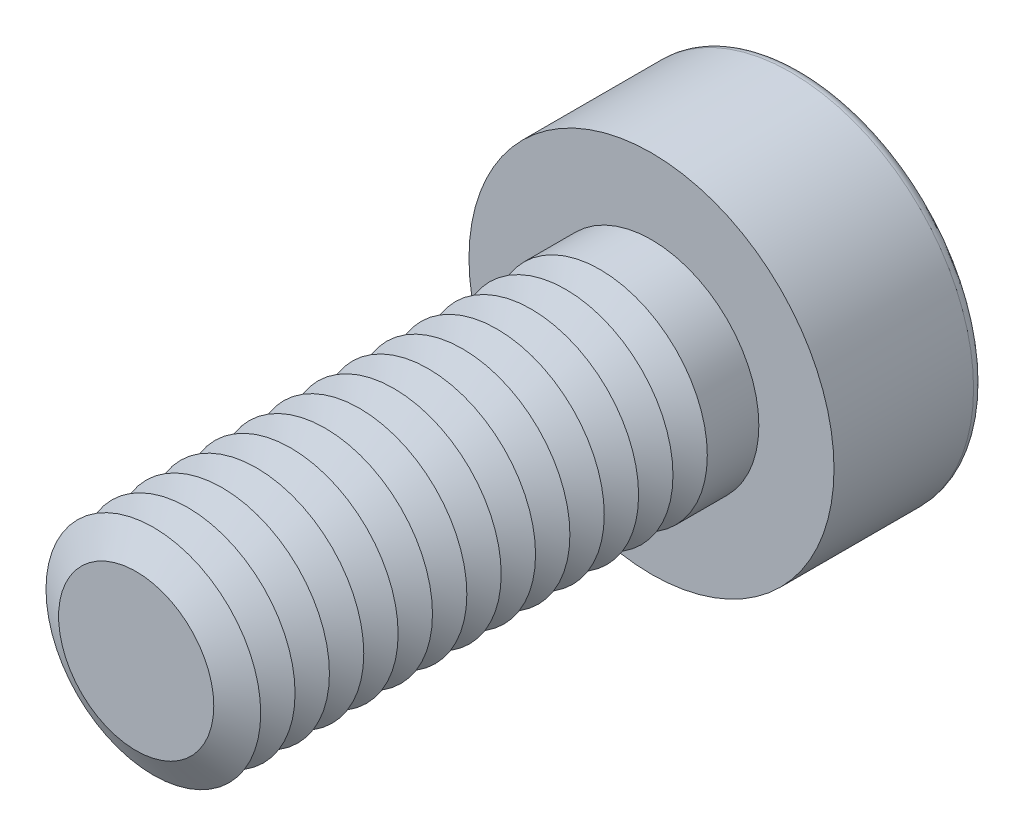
ISO-10303-21;
HEADER;
FILE_DESCRIPTION(('STEP AP214'),'2;1');
FILE_NAME('part.step','',(''),(''),'','','');
FILE_SCHEMA(('AUTOMOTIVE_DESIGN { 1 0 10303 214 1 1 1 1 }'));
ENDSEC;
DATA;
#1=APPLICATION_CONTEXT('core data for automotive mechanical design processes');
#2=APPLICATION_PROTOCOL_DEFINITION('international standard','automotive_design',2000,#1);
#3=PRODUCT_CONTEXT('',#1,'mechanical');
#4=PRODUCT('Part','Part','',(#3));
#5=PRODUCT_RELATED_PRODUCT_CATEGORY('part','',(#4));
#6=PRODUCT_DEFINITION_FORMATION('','',#4);
#7=PRODUCT_DEFINITION_CONTEXT('part definition',#1,'design');
#8=PRODUCT_DEFINITION('design','',#6,#7);
#9=PRODUCT_DEFINITION_SHAPE('','',#8);
#10=(LENGTH_UNIT() NAMED_UNIT(*) SI_UNIT(.MILLI.,.METRE.));
#11=(NAMED_UNIT(*) PLANE_ANGLE_UNIT() SI_UNIT($,.RADIAN.));
#12=(NAMED_UNIT(*) SI_UNIT($,.STERADIAN.) SOLID_ANGLE_UNIT());
#13=UNCERTAINTY_MEASURE_WITH_UNIT(LENGTH_MEASURE(1.E-05),#10,'distance_accuracy_value','');
#14=(GEOMETRIC_REPRESENTATION_CONTEXT(3) GLOBAL_UNCERTAINTY_ASSIGNED_CONTEXT((#13)) GLOBAL_UNIT_ASSIGNED_CONTEXT((#10,
#11,#12)) REPRESENTATION_CONTEXT('',''));
#15=CARTESIAN_POINT('',(0.,0.,0.));
#16=DIRECTION('',(0.,0.,1.));
#17=DIRECTION('',(1.,0.,0.));
#18=AXIS2_PLACEMENT_3D('',#15,#16,#17);
#19=CARTESIAN_POINT('',(0.,0.,9.2));
#20=DIRECTION('',(0.,0.,1.));
#21=DIRECTION('',(1.,0.,0.));
#22=AXIS2_PLACEMENT_3D('',#19,#20,#21);
#23=CONICAL_SURFACE('',#22,2.5,1.0471975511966);
#24=CARTESIAN_POINT('',(0.,0.,8.8));
#25=DIRECTION('',(0.,0.,1.));
#26=DIRECTION('',(1.,0.,0.));
#27=AXIS2_PLACEMENT_3D('',#24,#25,#26);
#28=CIRCLE('',#27,1.80717967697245);
#29=CARTESIAN_POINT('',(1.80717967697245,0.,8.8));
#30=VERTEX_POINT('',#29);
#31=EDGE_CURVE('E312',#30,#30,#28,.T.);
#32=ORIENTED_EDGE('',*,*,#31,.T.);
#33=EDGE_LOOP('',(#32));
#34=FACE_BOUND('',#33,.T.);
#35=CARTESIAN_POINT('',(0.,0.,9.2));
#36=DIRECTION('',(0.,0.,1.));
#37=DIRECTION('',(1.,0.,0.));
#38=AXIS2_PLACEMENT_3D('',#35,#36,#37);
#39=CIRCLE('',#38,2.5);
#40=CARTESIAN_POINT('',(2.5,0.,9.2));
#41=VERTEX_POINT('',#40);
#42=EDGE_CURVE('E315',#41,#41,#39,.T.);
#43=ORIENTED_EDGE('',*,*,#42,.F.);
#44=EDGE_LOOP('',(#43));
#45=FACE_BOUND('',#44,.T.);
#46=ADVANCED_FACE('F39',(#34,#45),#23,.T.);
#47=CARTESIAN_POINT('',(0.,0.,8.8));
#48=DIRECTION('',(0.,0.,-1.));
#49=DIRECTION('',(-1.,0.,0.));
#50=AXIS2_PLACEMENT_3D('',#47,#48,#49);
#51=CONICAL_SURFACE('',#50,1.80717967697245,1.0471975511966);
#52=CARTESIAN_POINT('',(0.,0.,8.4));
#53=DIRECTION('',(0.,0.,1.));
#54=DIRECTION('',(1.,0.,0.));
#55=AXIS2_PLACEMENT_3D('',#52,#53,#54);
#56=CIRCLE('',#55,2.5);
#57=CARTESIAN_POINT('',(2.5,0.,8.4));
#58=VERTEX_POINT('',#57);
#59=EDGE_CURVE('E323',#58,#58,#56,.T.);
#60=ORIENTED_EDGE('',*,*,#59,.T.);
#61=EDGE_LOOP('',(#60));
#62=FACE_BOUND('',#61,.T.);
#63=ORIENTED_EDGE('',*,*,#31,.F.);
#64=EDGE_LOOP('',(#63));
#65=FACE_BOUND('',#64,.T.);
#66=ADVANCED_FACE('F245',(#62,#65),#51,.T.);
#67=CARTESIAN_POINT('',(0.,0.,12.));
#68=DIRECTION('',(0.,0.,1.));
#69=DIRECTION('',(1.,0.,0.));
#70=AXIS2_PLACEMENT_3D('',#67,#68,#69);
#71=PLANE('',#70);
#72=CARTESIAN_POINT('',(0.,0.,12.));
#73=DIRECTION('',(0.,0.,1.));
#74=DIRECTION('',(1.,0.,0.));
#75=AXIS2_PLACEMENT_3D('',#72,#73,#74);
#76=CIRCLE('',#75,1.80717967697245);
#77=CARTESIAN_POINT('',(1.80717967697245,0.,12.));
#78=VERTEX_POINT('',#77);
#79=EDGE_CURVE('E174',#78,#78,#76,.T.);
#80=ORIENTED_EDGE('',*,*,#79,.T.);
#81=EDGE_LOOP('',(#80));
#82=FACE_BOUND('',#81,.T.);
#83=ADVANCED_FACE('F251',(#82),#71,.T.);
#84=CARTESIAN_POINT('',(0.,0.,12.));
#85=DIRECTION('',(0.,0.,-1.));
#86=DIRECTION('',(-1.,0.,0.));
#87=AXIS2_PLACEMENT_3D('',#84,#85,#86);
#88=CONICAL_SURFACE('',#87,1.80717967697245,1.0471975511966);
#89=CARTESIAN_POINT('',(0.,0.,11.6));
#90=DIRECTION('',(0.,0.,1.));
#91=DIRECTION('',(1.,0.,0.));
#92=AXIS2_PLACEMENT_3D('',#89,#90,#91);
#93=CIRCLE('',#92,2.5);
#94=CARTESIAN_POINT('',(2.5,0.,11.6));
#95=VERTEX_POINT('',#94);
#96=EDGE_CURVE('E291',#95,#95,#93,.T.);
#97=ORIENTED_EDGE('',*,*,#96,.T.);
#98=EDGE_LOOP('',(#97));
#99=FACE_BOUND('',#98,.T.);
#100=ORIENTED_EDGE('',*,*,#79,.F.);
#101=EDGE_LOOP('',(#100));
#102=FACE_BOUND('',#101,.T.);
#103=ADVANCED_FACE('F199',(#99,#102),#88,.T.);
#104=CARTESIAN_POINT('',(0.,0.,11.6));
#105=DIRECTION('',(0.,0.,1.));
#106=DIRECTION('',(1.,0.,0.));
#107=AXIS2_PLACEMENT_3D('',#104,#105,#106);
#108=CONICAL_SURFACE('',#107,2.5,1.0471975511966);
#109=CARTESIAN_POINT('',(0.,0.,11.2));
#110=DIRECTION('',(0.,0.,1.));
#111=DIRECTION('',(1.,0.,0.));
#112=AXIS2_PLACEMENT_3D('',#109,#110,#111);
#113=CIRCLE('',#112,1.80717967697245);
#114=CARTESIAN_POINT('',(1.80717967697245,0.,11.2));
#115=VERTEX_POINT('',#114);
#116=EDGE_CURVE('E288',#115,#115,#113,.T.);
#117=ORIENTED_EDGE('',*,*,#116,.T.);
#118=EDGE_LOOP('',(#117));
#119=FACE_BOUND('',#118,.T.);
#120=ORIENTED_EDGE('',*,*,#96,.F.);
#121=EDGE_LOOP('',(#120));
#122=FACE_BOUND('',#121,.T.);
#123=ADVANCED_FACE('F277',(#119,#122),#108,.T.);
#124=CARTESIAN_POINT('',(0.,0.,11.2));
#125=DIRECTION('',(0.,0.,-1.));
#126=DIRECTION('',(-1.,0.,0.));
#127=AXIS2_PLACEMENT_3D('',#124,#125,#126);
#128=CONICAL_SURFACE('',#127,1.80717967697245,1.0471975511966);
#129=CARTESIAN_POINT('',(0.,0.,10.8));
#130=DIRECTION('',(0.,0.,1.));
#131=DIRECTION('',(1.,0.,0.));
#132=AXIS2_PLACEMENT_3D('',#129,#130,#131);
#133=CIRCLE('',#132,2.5);
#134=CARTESIAN_POINT('',(2.5,0.,10.8));
#135=VERTEX_POINT('',#134);
#136=EDGE_CURVE('E299',#135,#135,#133,.T.);
#137=ORIENTED_EDGE('',*,*,#136,.T.);
#138=EDGE_LOOP('',(#137));
#139=FACE_BOUND('',#138,.T.);
#140=ORIENTED_EDGE('',*,*,#116,.F.);
#141=EDGE_LOOP('',(#140));
#142=FACE_BOUND('',#141,.T.);
#143=ADVANCED_FACE('F274',(#139,#142),#128,.T.);
#144=CARTESIAN_POINT('',(0.,0.,10.8));
#145=DIRECTION('',(0.,0.,1.));
#146=DIRECTION('',(1.,0.,0.));
#147=AXIS2_PLACEMENT_3D('',#144,#145,#146);
#148=CONICAL_SURFACE('',#147,2.5,1.0471975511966);
#149=CARTESIAN_POINT('',(0.,0.,10.4));
#150=DIRECTION('',(0.,0.,1.));
#151=DIRECTION('',(1.,0.,0.));
#152=AXIS2_PLACEMENT_3D('',#149,#150,#151);
#153=CIRCLE('',#152,1.80717967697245);
#154=CARTESIAN_POINT('',(1.80717967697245,0.,10.4));
#155=VERTEX_POINT('',#154);
#156=EDGE_CURVE('E293',#155,#155,#153,.T.);
#157=ORIENTED_EDGE('',*,*,#156,.T.);
#158=EDGE_LOOP('',(#157));
#159=FACE_BOUND('',#158,.T.);
#160=ORIENTED_EDGE('',*,*,#136,.F.);
#161=EDGE_LOOP('',(#160));
#162=FACE_BOUND('',#161,.T.);
#163=ADVANCED_FACE('F270',(#159,#162),#148,.T.);
#164=CARTESIAN_POINT('',(0.,0.,10.4));
#165=DIRECTION('',(0.,0.,-1.));
#166=DIRECTION('',(-1.,0.,0.));
#167=AXIS2_PLACEMENT_3D('',#164,#165,#166);
#168=CONICAL_SURFACE('',#167,1.80717967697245,1.0471975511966);
#169=CARTESIAN_POINT('',(0.,0.,10.));
#170=DIRECTION('',(0.,0.,1.));
#171=DIRECTION('',(1.,0.,0.));
#172=AXIS2_PLACEMENT_3D('',#169,#170,#171);
#173=CIRCLE('',#172,2.5);
#174=CARTESIAN_POINT('',(2.5,0.,10.));
#175=VERTEX_POINT('',#174);
#176=EDGE_CURVE('E308',#175,#175,#173,.T.);
#177=ORIENTED_EDGE('',*,*,#176,.T.);
#178=EDGE_LOOP('',(#177));
#179=FACE_BOUND('',#178,.T.);
#180=ORIENTED_EDGE('',*,*,#156,.F.);
#181=EDGE_LOOP('',(#180));
#182=FACE_BOUND('',#181,.T.);
#183=ADVANCED_FACE('F266',(#179,#182),#168,.T.);
#184=CARTESIAN_POINT('',(0.,0.,10.));
#185=DIRECTION('',(0.,0.,1.));
#186=DIRECTION('',(1.,0.,0.));
#187=AXIS2_PLACEMENT_3D('',#184,#185,#186);
#188=CONICAL_SURFACE('',#187,2.5,1.0471975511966);
#189=CARTESIAN_POINT('',(0.,0.,9.6));
#190=DIRECTION('',(0.,0.,1.));
#191=DIRECTION('',(1.,0.,0.));
#192=AXIS2_PLACEMENT_3D('',#189,#190,#191);
#193=CIRCLE('',#192,1.80717967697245);
#194=CARTESIAN_POINT('',(1.80717967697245,0.,9.6));
#195=VERTEX_POINT('',#194);
#196=EDGE_CURVE('E304',#195,#195,#193,.T.);
#197=ORIENTED_EDGE('',*,*,#196,.T.);
#198=EDGE_LOOP('',(#197));
#199=FACE_BOUND('',#198,.T.);
#200=ORIENTED_EDGE('',*,*,#176,.F.);
#201=EDGE_LOOP('',(#200));
#202=FACE_BOUND('',#201,.T.);
#203=ADVANCED_FACE('F262',(#199,#202),#188,.T.);
#204=CARTESIAN_POINT('',(0.,0.,9.6));
#205=DIRECTION('',(0.,0.,-1.));
#206=DIRECTION('',(-1.,0.,0.));
#207=AXIS2_PLACEMENT_3D('',#204,#205,#206);
#208=CONICAL_SURFACE('',#207,1.80717967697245,1.0471975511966);
#209=ORIENTED_EDGE('',*,*,#42,.T.);
#210=EDGE_LOOP('',(#209));
#211=FACE_BOUND('',#210,.T.);
#212=ORIENTED_EDGE('',*,*,#196,.F.);
#213=EDGE_LOOP('',(#212));
#214=FACE_BOUND('',#213,.T.);
#215=ADVANCED_FACE('F258',(#211,#214),#208,.T.);
#216=CARTESIAN_POINT('',(0.,0.,8.4));
#217=DIRECTION('',(0.,0.,1.));
#218=DIRECTION('',(1.,0.,0.));
#219=AXIS2_PLACEMENT_3D('',#216,#217,#218);
#220=CONICAL_SURFACE('',#219,2.5,1.0471975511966);
#221=CARTESIAN_POINT('',(0.,0.,8.));
#222=DIRECTION('',(0.,0.,1.));
#223=DIRECTION('',(1.,0.,0.));
#224=AXIS2_PLACEMENT_3D('',#221,#222,#223);
#225=CIRCLE('',#224,1.80717967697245);
#226=CARTESIAN_POINT('',(1.80717967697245,0.,8.));
#227=VERTEX_POINT('',#226);
#228=EDGE_CURVE('E319',#227,#227,#225,.T.);
#229=ORIENTED_EDGE('',*,*,#228,.T.);
#230=EDGE_LOOP('',(#229));
#231=FACE_BOUND('',#230,.T.);
#232=ORIENTED_EDGE('',*,*,#59,.F.);
#233=EDGE_LOOP('',(#232));
#234=FACE_BOUND('',#233,.T.);
#235=ADVANCED_FACE('F261',(#231,#234),#220,.T.);
#236=CARTESIAN_POINT('',(0.,0.,8.));
#237=DIRECTION('',(0.,0.,-1.));
#238=DIRECTION('',(-1.,0.,0.));
#239=AXIS2_PLACEMENT_3D('',#236,#237,#238);
#240=CONICAL_SURFACE('',#239,1.80717967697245,1.0471975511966);
#241=CARTESIAN_POINT('',(0.,0.,7.6));
#242=DIRECTION('',(0.,0.,1.));
#243=DIRECTION('',(1.,0.,0.));
#244=AXIS2_PLACEMENT_3D('',#241,#242,#243);
#245=CIRCLE('',#244,2.5);
#246=CARTESIAN_POINT('',(2.5,0.,7.6));
#247=VERTEX_POINT('',#246);
#248=EDGE_CURVE('E331',#247,#247,#245,.T.);
#249=ORIENTED_EDGE('',*,*,#248,.T.);
#250=EDGE_LOOP('',(#249));
#251=FACE_BOUND('',#250,.T.);
#252=ORIENTED_EDGE('',*,*,#228,.F.);
#253=EDGE_LOOP('',(#252));
#254=FACE_BOUND('',#253,.T.);
#255=ADVANCED_FACE('F464',(#251,#254),#240,.T.);
#256=CARTESIAN_POINT('',(0.,0.,7.6));
#257=DIRECTION('',(0.,0.,1.));
#258=DIRECTION('',(1.,0.,0.));
#259=AXIS2_PLACEMENT_3D('',#256,#257,#258);
#260=CONICAL_SURFACE('',#259,2.5,1.0471975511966);
#261=CARTESIAN_POINT('',(0.,0.,7.2));
#262=DIRECTION('',(0.,0.,1.));
#263=DIRECTION('',(1.,0.,0.));
#264=AXIS2_PLACEMENT_3D('',#261,#262,#263);
#265=CIRCLE('',#264,1.80717967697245);
#266=CARTESIAN_POINT('',(1.80717967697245,0.,7.2));
#267=VERTEX_POINT('',#266);
#268=EDGE_CURVE('E327',#267,#267,#265,.T.);
#269=ORIENTED_EDGE('',*,*,#268,.T.);
#270=EDGE_LOOP('',(#269));
#271=FACE_BOUND('',#270,.T.);
#272=ORIENTED_EDGE('',*,*,#248,.F.);
#273=EDGE_LOOP('',(#272));
#274=FACE_BOUND('',#273,.T.);
#275=ADVANCED_FACE('F460',(#271,#274),#260,.T.);
#276=CARTESIAN_POINT('',(0.,0.,7.2));
#277=DIRECTION('',(0.,0.,-1.));
#278=DIRECTION('',(-1.,0.,0.));
#279=AXIS2_PLACEMENT_3D('',#276,#277,#278);
#280=CONICAL_SURFACE('',#279,1.80717967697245,1.0471975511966);
#281=CARTESIAN_POINT('',(0.,0.,6.8));
#282=DIRECTION('',(0.,0.,1.));
#283=DIRECTION('',(1.,0.,0.));
#284=AXIS2_PLACEMENT_3D('',#281,#282,#283);
#285=CIRCLE('',#284,2.5);
#286=CARTESIAN_POINT('',(2.5,0.,6.8));
#287=VERTEX_POINT('',#286);
#288=EDGE_CURVE('E339',#287,#287,#285,.T.);
#289=ORIENTED_EDGE('',*,*,#288,.T.);
#290=EDGE_LOOP('',(#289));
#291=FACE_BOUND('',#290,.T.);
#292=ORIENTED_EDGE('',*,*,#268,.F.);
#293=EDGE_LOOP('',(#292));
#294=FACE_BOUND('',#293,.T.);
#295=ADVANCED_FACE('F456',(#291,#294),#280,.T.);
#296=CARTESIAN_POINT('',(0.,0.,6.8));
#297=DIRECTION('',(0.,0.,1.));
#298=DIRECTION('',(1.,0.,0.));
#299=AXIS2_PLACEMENT_3D('',#296,#297,#298);
#300=CONICAL_SURFACE('',#299,2.5,1.0471975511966);
#301=CARTESIAN_POINT('',(0.,0.,6.4));
#302=DIRECTION('',(0.,0.,1.));
#303=DIRECTION('',(1.,0.,0.));
#304=AXIS2_PLACEMENT_3D('',#301,#302,#303);
#305=CIRCLE('',#304,1.80717967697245);
#306=CARTESIAN_POINT('',(1.80717967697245,0.,6.4));
#307=VERTEX_POINT('',#306);
#308=EDGE_CURVE('E335',#307,#307,#305,.T.);
#309=ORIENTED_EDGE('',*,*,#308,.T.);
#310=EDGE_LOOP('',(#309));
#311=FACE_BOUND('',#310,.T.);
#312=ORIENTED_EDGE('',*,*,#288,.F.);
#313=EDGE_LOOP('',(#312));
#314=FACE_BOUND('',#313,.T.);
#315=ADVANCED_FACE('F452',(#311,#314),#300,.T.);
#316=CARTESIAN_POINT('',(0.,0.,6.4));
#317=DIRECTION('',(0.,0.,-1.));
#318=DIRECTION('',(-1.,0.,0.));
#319=AXIS2_PLACEMENT_3D('',#316,#317,#318);
#320=CONICAL_SURFACE('',#319,1.80717967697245,1.0471975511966);
#321=CARTESIAN_POINT('',(0.,0.,6.));
#322=DIRECTION('',(0.,0.,1.));
#323=DIRECTION('',(1.,0.,0.));
#324=AXIS2_PLACEMENT_3D('',#321,#322,#323);
#325=CIRCLE('',#324,2.5);
#326=CARTESIAN_POINT('',(2.5,0.,6.));
#327=VERTEX_POINT('',#326);
#328=EDGE_CURVE('E347',#327,#327,#325,.T.);
#329=ORIENTED_EDGE('',*,*,#328,.T.);
#330=EDGE_LOOP('',(#329));
#331=FACE_BOUND('',#330,.T.);
#332=ORIENTED_EDGE('',*,*,#308,.F.);
#333=EDGE_LOOP('',(#332));
#334=FACE_BOUND('',#333,.T.);
#335=ADVANCED_FACE('F448',(#331,#334),#320,.T.);
#336=CARTESIAN_POINT('',(0.,0.,6.));
#337=DIRECTION('',(0.,0.,1.));
#338=DIRECTION('',(1.,0.,0.));
#339=AXIS2_PLACEMENT_3D('',#336,#337,#338);
#340=CONICAL_SURFACE('',#339,2.5,1.0471975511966);
#341=CARTESIAN_POINT('',(0.,0.,5.6));
#342=DIRECTION('',(0.,0.,1.));
#343=DIRECTION('',(1.,0.,0.));
#344=AXIS2_PLACEMENT_3D('',#341,#342,#343);
#345=CIRCLE('',#344,1.80717967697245);
#346=CARTESIAN_POINT('',(1.80717967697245,0.,5.6));
#347=VERTEX_POINT('',#346);
#348=EDGE_CURVE('E343',#347,#347,#345,.T.);
#349=ORIENTED_EDGE('',*,*,#348,.T.);
#350=EDGE_LOOP('',(#349));
#351=FACE_BOUND('',#350,.T.);
#352=ORIENTED_EDGE('',*,*,#328,.F.);
#353=EDGE_LOOP('',(#352));
#354=FACE_BOUND('',#353,.T.);
#355=ADVANCED_FACE('F444',(#351,#354),#340,.T.);
#356=CARTESIAN_POINT('',(0.,0.,5.6));
#357=DIRECTION('',(0.,0.,-1.));
#358=DIRECTION('',(-1.,0.,0.));
#359=AXIS2_PLACEMENT_3D('',#356,#357,#358);
#360=CONICAL_SURFACE('',#359,1.80717967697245,1.0471975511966);
#361=CARTESIAN_POINT('',(0.,0.,5.2));
#362=DIRECTION('',(0.,0.,1.));
#363=DIRECTION('',(1.,0.,0.));
#364=AXIS2_PLACEMENT_3D('',#361,#362,#363);
#365=CIRCLE('',#364,2.5);
#366=CARTESIAN_POINT('',(2.5,0.,5.2));
#367=VERTEX_POINT('',#366);
#368=EDGE_CURVE('E355',#367,#367,#365,.T.);
#369=ORIENTED_EDGE('',*,*,#368,.T.);
#370=EDGE_LOOP('',(#369));
#371=FACE_BOUND('',#370,.T.);
#372=ORIENTED_EDGE('',*,*,#348,.F.);
#373=EDGE_LOOP('',(#372));
#374=FACE_BOUND('',#373,.T.);
#375=ADVANCED_FACE('F440',(#371,#374),#360,.T.);
#376=CARTESIAN_POINT('',(0.,0.,5.2));
#377=DIRECTION('',(0.,0.,1.));
#378=DIRECTION('',(1.,0.,0.));
#379=AXIS2_PLACEMENT_3D('',#376,#377,#378);
#380=CONICAL_SURFACE('',#379,2.5,1.0471975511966);
#381=CARTESIAN_POINT('',(0.,0.,4.8));
#382=DIRECTION('',(0.,0.,1.));
#383=DIRECTION('',(1.,0.,0.));
#384=AXIS2_PLACEMENT_3D('',#381,#382,#383);
#385=CIRCLE('',#384,1.80717967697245);
#386=CARTESIAN_POINT('',(1.80717967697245,0.,4.8));
#387=VERTEX_POINT('',#386);
#388=EDGE_CURVE('E351',#387,#387,#385,.T.);
#389=ORIENTED_EDGE('',*,*,#388,.T.);
#390=EDGE_LOOP('',(#389));
#391=FACE_BOUND('',#390,.T.);
#392=ORIENTED_EDGE('',*,*,#368,.F.);
#393=EDGE_LOOP('',(#392));
#394=FACE_BOUND('',#393,.T.);
#395=ADVANCED_FACE('F436',(#391,#394),#380,.T.);
#396=CARTESIAN_POINT('',(0.,0.,4.8));
#397=DIRECTION('',(0.,0.,-1.));
#398=DIRECTION('',(-1.,0.,0.));
#399=AXIS2_PLACEMENT_3D('',#396,#397,#398);
#400=CONICAL_SURFACE('',#399,1.80717967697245,1.0471975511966);
#401=CARTESIAN_POINT('',(0.,0.,4.4));
#402=DIRECTION('',(0.,0.,1.));
#403=DIRECTION('',(1.,0.,0.));
#404=AXIS2_PLACEMENT_3D('',#401,#402,#403);
#405=CIRCLE('',#404,2.5);
#406=CARTESIAN_POINT('',(2.5,0.,4.4));
#407=VERTEX_POINT('',#406);
#408=EDGE_CURVE('E363',#407,#407,#405,.T.);
#409=ORIENTED_EDGE('',*,*,#408,.T.);
#410=EDGE_LOOP('',(#409));
#411=FACE_BOUND('',#410,.T.);
#412=ORIENTED_EDGE('',*,*,#388,.F.);
#413=EDGE_LOOP('',(#412));
#414=FACE_BOUND('',#413,.T.);
#415=ADVANCED_FACE('F432',(#411,#414),#400,.T.);
#416=CARTESIAN_POINT('',(0.,0.,4.4));
#417=DIRECTION('',(0.,0.,1.));
#418=DIRECTION('',(1.,0.,0.));
#419=AXIS2_PLACEMENT_3D('',#416,#417,#418);
#420=CONICAL_SURFACE('',#419,2.5,1.0471975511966);
#421=CARTESIAN_POINT('',(0.,0.,4.));
#422=DIRECTION('',(0.,0.,1.));
#423=DIRECTION('',(1.,0.,0.));
#424=AXIS2_PLACEMENT_3D('',#421,#422,#423);
#425=CIRCLE('',#424,1.80717967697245);
#426=CARTESIAN_POINT('',(1.80717967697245,0.,4.));
#427=VERTEX_POINT('',#426);
#428=EDGE_CURVE('E359',#427,#427,#425,.T.);
#429=ORIENTED_EDGE('',*,*,#428,.T.);
#430=EDGE_LOOP('',(#429));
#431=FACE_BOUND('',#430,.T.);
#432=ORIENTED_EDGE('',*,*,#408,.F.);
#433=EDGE_LOOP('',(#432));
#434=FACE_BOUND('',#433,.T.);
#435=ADVANCED_FACE('F428',(#431,#434),#420,.T.);
#436=CARTESIAN_POINT('',(0.,0.,4.));
#437=DIRECTION('',(0.,0.,-1.));
#438=DIRECTION('',(-1.,0.,0.));
#439=AXIS2_PLACEMENT_3D('',#436,#437,#438);
#440=CONICAL_SURFACE('',#439,1.80717967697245,1.0471975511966);
#441=CARTESIAN_POINT('',(0.,0.,3.6));
#442=DIRECTION('',(0.,0.,1.));
#443=DIRECTION('',(1.,0.,0.));
#444=AXIS2_PLACEMENT_3D('',#441,#442,#443);
#445=CIRCLE('',#444,2.5);
#446=CARTESIAN_POINT('',(2.5,0.,3.6));
#447=VERTEX_POINT('',#446);
#448=EDGE_CURVE('E371',#447,#447,#445,.T.);
#449=ORIENTED_EDGE('',*,*,#448,.T.);
#450=EDGE_LOOP('',(#449));
#451=FACE_BOUND('',#450,.T.);
#452=ORIENTED_EDGE('',*,*,#428,.F.);
#453=EDGE_LOOP('',(#452));
#454=FACE_BOUND('',#453,.T.);
#455=ADVANCED_FACE('F424',(#451,#454),#440,.T.);
#456=CARTESIAN_POINT('',(0.,0.,3.6));
#457=DIRECTION('',(0.,0.,1.));
#458=DIRECTION('',(1.,0.,0.));
#459=AXIS2_PLACEMENT_3D('',#456,#457,#458);
#460=CONICAL_SURFACE('',#459,2.5,1.0471975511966);
#461=CARTESIAN_POINT('',(0.,0.,3.2));
#462=DIRECTION('',(0.,0.,1.));
#463=DIRECTION('',(1.,0.,0.));
#464=AXIS2_PLACEMENT_3D('',#461,#462,#463);
#465=CIRCLE('',#464,1.80717967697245);
#466=CARTESIAN_POINT('',(1.80717967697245,0.,3.2));
#467=VERTEX_POINT('',#466);
#468=EDGE_CURVE('E367',#467,#467,#465,.T.);
#469=ORIENTED_EDGE('',*,*,#468,.T.);
#470=EDGE_LOOP('',(#469));
#471=FACE_BOUND('',#470,.T.);
#472=ORIENTED_EDGE('',*,*,#448,.F.);
#473=EDGE_LOOP('',(#472));
#474=FACE_BOUND('',#473,.T.);
#475=ADVANCED_FACE('F420',(#471,#474),#460,.T.);
#476=CARTESIAN_POINT('',(0.,0.,3.2));
#477=DIRECTION('',(0.,0.,-1.));
#478=DIRECTION('',(-1.,0.,0.));
#479=AXIS2_PLACEMENT_3D('',#476,#477,#478);
#480=CONICAL_SURFACE('',#479,1.80717967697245,1.0471975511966);
#481=CARTESIAN_POINT('',(0.,0.,2.8));
#482=DIRECTION('',(0.,0.,1.));
#483=DIRECTION('',(1.,0.,0.));
#484=AXIS2_PLACEMENT_3D('',#481,#482,#483);
#485=CIRCLE('',#484,2.5);
#486=CARTESIAN_POINT('',(2.5,0.,2.8));
#487=VERTEX_POINT('',#486);
#488=EDGE_CURVE('E379',#487,#487,#485,.T.);
#489=ORIENTED_EDGE('',*,*,#488,.T.);
#490=EDGE_LOOP('',(#489));
#491=FACE_BOUND('',#490,.T.);
#492=ORIENTED_EDGE('',*,*,#468,.F.);
#493=EDGE_LOOP('',(#492));
#494=FACE_BOUND('',#493,.T.);
#495=ADVANCED_FACE('F416',(#491,#494),#480,.T.);
#496=CARTESIAN_POINT('',(0.,0.,2.8));
#497=DIRECTION('',(0.,0.,1.));
#498=DIRECTION('',(1.,0.,0.));
#499=AXIS2_PLACEMENT_3D('',#496,#497,#498);
#500=CONICAL_SURFACE('',#499,2.5,1.0471975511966);
#501=CARTESIAN_POINT('',(0.,0.,2.4));
#502=DIRECTION('',(0.,0.,1.));
#503=DIRECTION('',(1.,0.,0.));
#504=AXIS2_PLACEMENT_3D('',#501,#502,#503);
#505=CIRCLE('',#504,1.80717967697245);
#506=CARTESIAN_POINT('',(1.80717967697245,0.,2.4));
#507=VERTEX_POINT('',#506);
#508=EDGE_CURVE('E375',#507,#507,#505,.T.);
#509=ORIENTED_EDGE('',*,*,#508,.T.);
#510=EDGE_LOOP('',(#509));
#511=FACE_BOUND('',#510,.T.);
#512=ORIENTED_EDGE('',*,*,#488,.F.);
#513=EDGE_LOOP('',(#512));
#514=FACE_BOUND('',#513,.T.);
#515=ADVANCED_FACE('F411',(#511,#514),#500,.T.);
#516=CARTESIAN_POINT('',(0.,0.,2.4));
#517=DIRECTION('',(0.,0.,-1.));
#518=DIRECTION('',(-1.,0.,0.));
#519=AXIS2_PLACEMENT_3D('',#516,#517,#518);
#520=CONICAL_SURFACE('',#519,1.80717967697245,1.0471975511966);
#521=CARTESIAN_POINT('',(0.,0.,2.));
#522=DIRECTION('',(0.,0.,1.));
#523=DIRECTION('',(1.,0.,0.));
#524=AXIS2_PLACEMENT_3D('',#521,#522,#523);
#525=CIRCLE('',#524,2.5);
#526=CARTESIAN_POINT('',(2.5,0.,2.));
#527=VERTEX_POINT('',#526);
#528=EDGE_CURVE('E391',#527,#527,#525,.T.);
#529=ORIENTED_EDGE('',*,*,#528,.T.);
#530=EDGE_LOOP('',(#529));
#531=FACE_BOUND('',#530,.T.);
#532=ORIENTED_EDGE('',*,*,#508,.F.);
#533=EDGE_LOOP('',(#532));
#534=FACE_BOUND('',#533,.T.);
#535=ADVANCED_FACE('F397',(#531,#534),#520,.T.);
#536=CARTESIAN_POINT('',(0.,0.,2.));
#537=DIRECTION('',(0.,0.,1.));
#538=DIRECTION('',(1.,0.,0.));
#539=AXIS2_PLACEMENT_3D('',#536,#537,#538);
#540=CONICAL_SURFACE('',#539,2.5,1.0471975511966);
#541=CARTESIAN_POINT('',(0.,0.,1.6));
#542=DIRECTION('',(0.,0.,1.));
#543=DIRECTION('',(1.,0.,0.));
#544=AXIS2_PLACEMENT_3D('',#541,#542,#543);
#545=CIRCLE('',#544,1.80717967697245);
#546=CARTESIAN_POINT('',(1.80717967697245,0.,1.6));
#547=VERTEX_POINT('',#546);
#548=EDGE_CURVE('E383',#547,#547,#545,.T.);
#549=ORIENTED_EDGE('',*,*,#548,.T.);
#550=EDGE_LOOP('',(#549));
#551=FACE_BOUND('',#550,.T.);
#552=ORIENTED_EDGE('',*,*,#528,.F.);
#553=EDGE_LOOP('',(#552));
#554=FACE_BOUND('',#553,.T.);
#555=ADVANCED_FACE('F400',(#551,#554),#540,.T.);
#556=CARTESIAN_POINT('',(0.,0.,1.6));
#557=DIRECTION('',(0.,0.,-1.));
#558=DIRECTION('',(-1.,0.,0.));
#559=AXIS2_PLACEMENT_3D('',#556,#557,#558);
#560=CONICAL_SURFACE('',#559,1.80717967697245,1.0471975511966);
#561=CARTESIAN_POINT('',(0.,0.,1.2));
#562=DIRECTION('',(0.,0.,1.));
#563=DIRECTION('',(1.,0.,0.));
#564=AXIS2_PLACEMENT_3D('',#561,#562,#563);
#565=CIRCLE('',#564,2.5);
#566=CARTESIAN_POINT('',(2.5,0.,1.2));
#567=VERTEX_POINT('',#566);
#568=EDGE_CURVE('E387',#567,#567,#565,.T.);
#569=ORIENTED_EDGE('',*,*,#568,.T.);
#570=EDGE_LOOP('',(#569));
#571=FACE_BOUND('',#570,.T.);
#572=ORIENTED_EDGE('',*,*,#548,.F.);
#573=EDGE_LOOP('',(#572));
#574=FACE_BOUND('',#573,.T.);
#575=ADVANCED_FACE('F402',(#571,#574),#560,.T.);
#576=CARTESIAN_POINT('',(0.,0.,-1.25));
#577=DIRECTION('',(0.,0.,-1.));
#578=DIRECTION('',(-1.,0.,0.));
#579=AXIS2_PLACEMENT_3D('',#576,#577,#578);
#580=CONICAL_SURFACE('',#579,1.5,1.0471975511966);
#581=CARTESIAN_POINT('',(0.,0.,-0.383974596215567));
#582=VERTEX_POINT('',#581);
#583=VERTEX_LOOP('',#582);
#584=FACE_BOUND('',#583,.T.);
#585=CARTESIAN_POINT('',(0.,0.,-1.25));
#586=DIRECTION('',(0.,0.,-1.));
#587=DIRECTION('',(-1.,0.,0.));
#588=AXIS2_PLACEMENT_3D('',#585,#586,#587);
#589=CIRCLE('',#588,1.5);
#590=CARTESIAN_POINT('',(-1.29903810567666,0.749999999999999,-1.25));
#591=VERTEX_POINT('',#590);
#592=CARTESIAN_POINT('',(0.,1.5,-1.25));
#593=VERTEX_POINT('',#592);
#594=EDGE_CURVE('E149',#591,#593,#589,.T.);
#595=ORIENTED_EDGE('',*,*,#594,.T.);
#596=CARTESIAN_POINT('',(0.,0.,-1.25));
#597=DIRECTION('',(0.,0.,-1.));
#598=DIRECTION('',(-1.,0.,0.));
#599=AXIS2_PLACEMENT_3D('',#596,#597,#598);
#600=CIRCLE('',#599,1.5);
#601=CARTESIAN_POINT('',(1.29903810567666,0.75,-1.25));
#602=VERTEX_POINT('',#601);
#603=EDGE_CURVE('E54',#593,#602,#600,.T.);
#604=ORIENTED_EDGE('',*,*,#603,.T.);
#605=CARTESIAN_POINT('',(1.29903810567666,-0.75,-1.25));
#606=VERTEX_POINT('',#605);
#607=EDGE_CURVE('E936',#602,#606,#600,.T.);
#608=ORIENTED_EDGE('',*,*,#607,.T.);
#609=CARTESIAN_POINT('',(0.,-1.5,-1.25));
#610=VERTEX_POINT('',#609);
#611=EDGE_CURVE('E934',#606,#610,#600,.T.);
#612=ORIENTED_EDGE('',*,*,#611,.T.);
#613=CARTESIAN_POINT('',(-1.29903810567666,-0.749999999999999,-1.25));
#614=VERTEX_POINT('',#613);
#615=EDGE_CURVE('E929',#610,#614,#600,.T.);
#616=ORIENTED_EDGE('',*,*,#615,.T.);
#617=EDGE_CURVE('E928',#614,#591,#600,.T.);
#618=ORIENTED_EDGE('',*,*,#617,.T.);
#619=EDGE_LOOP('',(#595,#604,#608,#612,#616,#618));
#620=FACE_BOUND('',#619,.T.);
#621=ADVANCED_FACE('F201',(#584,#620),#580,.F.);
#622=CARTESIAN_POINT('',(0.,0.,-1.25));
#623=DIRECTION('',(0.,0.,-1.));
#624=DIRECTION('',(-1.,0.,0.));
#625=AXIS2_PLACEMENT_3D('',#622,#623,#624);
#626=PLANE('',#625);
#627=ORIENTED_EDGE('',*,*,#603,.F.);
#628=DIRECTION('',(1.,0.,0.));
#629=VECTOR('',#628,1.);
#630=CARTESIAN_POINT('',(-0.866025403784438,1.5,-1.25));
#631=LINE('',#630,#629);
#632=CARTESIAN_POINT('',(0.86602540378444,1.5,-1.25));
#633=VERTEX_POINT('',#632);
#634=EDGE_CURVE('E979',#593,#633,#631,.T.);
#635=ORIENTED_EDGE('',*,*,#634,.T.);
#636=DIRECTION('',(0.5,-0.866025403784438,0.));
#637=VECTOR('',#636,1.);
#638=CARTESIAN_POINT('',(0.86602540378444,1.5,-1.25));
#639=LINE('',#638,#637);
#640=EDGE_CURVE('E155',#633,#602,#639,.T.);
#641=ORIENTED_EDGE('',*,*,#640,.T.);
#642=EDGE_LOOP('',(#627,#635,#641));
#643=FACE_BOUND('',#642,.T.);
#644=ADVANCED_FACE('F541',(#643),#626,.T.);
#645=ORIENTED_EDGE('',*,*,#607,.F.);
#646=CARTESIAN_POINT('',(1.73205080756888,0.,-1.25));
#647=VERTEX_POINT('',#646);
#648=EDGE_CURVE('E978',#602,#647,#639,.T.);
#649=ORIENTED_EDGE('',*,*,#648,.T.);
#650=DIRECTION('',(-0.5,-0.866025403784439,0.));
#651=VECTOR('',#650,1.);
#652=CARTESIAN_POINT('',(1.73205080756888,0.,-1.25));
#653=LINE('',#652,#651);
#654=EDGE_CURVE('E949',#647,#606,#653,.T.);
#655=ORIENTED_EDGE('',*,*,#654,.T.);
#656=EDGE_LOOP('',(#645,#649,#655));
#657=FACE_BOUND('',#656,.T.);
#658=ADVANCED_FACE('F551',(#657),#626,.T.);
#659=ORIENTED_EDGE('',*,*,#611,.F.);
#660=CARTESIAN_POINT('',(0.86602540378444,-1.5,-1.25));
#661=VERTEX_POINT('',#660);
#662=EDGE_CURVE('E951',#606,#661,#653,.T.);
#663=ORIENTED_EDGE('',*,*,#662,.T.);
#664=DIRECTION('',(-1.,0.,0.));
#665=VECTOR('',#664,1.);
#666=CARTESIAN_POINT('',(0.86602540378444,-1.5,-1.25));
#667=LINE('',#666,#665);
#668=EDGE_CURVE('E902',#661,#610,#667,.T.);
#669=ORIENTED_EDGE('',*,*,#668,.T.);
#670=EDGE_LOOP('',(#659,#663,#669));
#671=FACE_BOUND('',#670,.T.);
#672=ADVANCED_FACE('F561',(#671),#626,.T.);
#673=ORIENTED_EDGE('',*,*,#615,.F.);
#674=CARTESIAN_POINT('',(-0.866025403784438,-1.5,-1.25));
#675=VERTEX_POINT('',#674);
#676=EDGE_CURVE('E945',#610,#675,#667,.T.);
#677=ORIENTED_EDGE('',*,*,#676,.T.);
#678=DIRECTION('',(-0.5,0.866025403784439,0.));
#679=VECTOR('',#678,1.);
#680=CARTESIAN_POINT('',(-0.866025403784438,-1.5,-1.25));
#681=LINE('',#680,#679);
#682=EDGE_CURVE('E947',#675,#614,#681,.T.);
#683=ORIENTED_EDGE('',*,*,#682,.T.);
#684=EDGE_LOOP('',(#673,#677,#683));
#685=FACE_BOUND('',#684,.T.);
#686=ADVANCED_FACE('F569',(#685),#626,.T.);
#687=ORIENTED_EDGE('',*,*,#617,.F.);
#688=CARTESIAN_POINT('',(-1.73205080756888,0.,-1.25));
#689=VERTEX_POINT('',#688);
#690=EDGE_CURVE('E952',#614,#689,#681,.T.);
#691=ORIENTED_EDGE('',*,*,#690,.T.);
#692=DIRECTION('',(0.5,0.866025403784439,0.));
#693=VECTOR('',#692,1.);
#694=CARTESIAN_POINT('',(-1.73205080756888,0.,-1.25));
#695=LINE('',#694,#693);
#696=EDGE_CURVE('E158',#689,#591,#695,.T.);
#697=ORIENTED_EDGE('',*,*,#696,.T.);
#698=EDGE_LOOP('',(#687,#691,#697));
#699=FACE_BOUND('',#698,.T.);
#700=ADVANCED_FACE('F231',(#699),#626,.T.);
#701=ORIENTED_EDGE('',*,*,#594,.F.);
#702=CARTESIAN_POINT('',(-0.866025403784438,1.5,-1.25));
#703=VERTEX_POINT('',#702);
#704=EDGE_CURVE('E959',#591,#703,#695,.T.);
#705=ORIENTED_EDGE('',*,*,#704,.T.);
#706=EDGE_CURVE('E976',#703,#593,#631,.T.);
#707=ORIENTED_EDGE('',*,*,#706,.T.);
#708=EDGE_LOOP('',(#701,#705,#707));
#709=FACE_BOUND('',#708,.T.);
#710=ADVANCED_FACE('F553',(#709),#626,.T.);
#711=CARTESIAN_POINT('',(-0.866025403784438,1.5,-1.25));
#712=DIRECTION('',(0.,1.,0.));
#713=DIRECTION('',(-1.,0.,0.));
#714=AXIS2_PLACEMENT_3D('',#711,#712,#713);
#715=PLANE('',#714);
#716=DIRECTION('',(0.,0.,-1.));
#717=VECTOR('',#716,1.);
#718=CARTESIAN_POINT('',(-0.866025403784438,1.5,-1.25));
#719=LINE('',#718,#717);
#720=CARTESIAN_POINT('',(-0.866025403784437,1.5,-3.5));
#721=VERTEX_POINT('',#720);
#722=EDGE_CURVE('E147',#703,#721,#719,.T.);
#723=ORIENTED_EDGE('',*,*,#722,.T.);
#724=CARTESIAN_POINT('',(-2.26080568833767,1.5,-3.76288767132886));
#725=CARTESIAN_POINT('',(-2.19307335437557,1.5,-3.74776718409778));
#726=CARTESIAN_POINT('',(-2.12529797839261,1.5,-3.73283936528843));
#727=CARTESIAN_POINT('',(-1.989639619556,1.5,-3.7034664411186));
#728=CARTESIAN_POINT('',(-1.92175663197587,1.5,-3.6890213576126));
#729=CARTESIAN_POINT('',(-1.71778516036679,1.5,-3.6465295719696));
#730=CARTESIAN_POINT('',(-1.58151166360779,1.5,-3.61935744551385));
#731=CARTESIAN_POINT('',(-1.30947840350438,1.5,-3.56878855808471));
#732=CARTESIAN_POINT('',(-1.17372447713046,1.5,-3.54536102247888));
#733=CARTESIAN_POINT('',(-0.90140428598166,1.5,-3.50385032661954));
#734=CARTESIAN_POINT('',(-0.764838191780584,1.5,-3.48576608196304));
#735=CARTESIAN_POINT('',(-0.489293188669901,1.5,-3.45729203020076));
#736=CARTESIAN_POINT('',(-0.350304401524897,1.5,-3.44699084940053));
#737=CARTESIAN_POINT('',(-0.14157144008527,1.5,-3.43918165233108));
#738=CARTESIAN_POINT('',(-0.0719628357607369,1.5,-3.43785196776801));
#739=CARTESIAN_POINT('',(0.0672555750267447,1.5,-3.43779336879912));
#740=CARTESIAN_POINT('',(0.136865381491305,1.5,-3.43906445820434));
#741=CARTESIAN_POINT('',(0.346114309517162,1.5,-3.44672257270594));
#742=CARTESIAN_POINT('',(0.48561964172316,1.5,-3.45697478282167));
#743=CARTESIAN_POINT('',(0.76382969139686,1.5,-3.48560011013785));
#744=CARTESIAN_POINT('',(0.902533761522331,1.5,-3.50397905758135));
#745=CARTESIAN_POINT('',(1.18270277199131,1.5,-3.54677522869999));
#746=CARTESIAN_POINT('',(1.32414472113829,1.5,-3.57133816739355));
#747=CARTESIAN_POINT('',(1.60634089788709,1.5,-3.62417713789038));
#748=CARTESIAN_POINT('',(1.74709501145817,1.5,-3.65245376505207));
#749=CARTESIAN_POINT('',(2.02813527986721,1.5,-3.71141289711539));
#750=CARTESIAN_POINT('',(2.16842128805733,1.5,-3.74209609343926));
#751=CARTESIAN_POINT('',(2.44863558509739,1.5,-3.80505759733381));
#752=CARTESIAN_POINT('',(2.5885638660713,1.5,-3.8373359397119));
#753=CARTESIAN_POINT('',(2.86645602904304,1.5,-3.90258693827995));
#754=CARTESIAN_POINT('',(3.0044230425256,1.5,-3.93554631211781));
#755=CARTESIAN_POINT('',(3.28017563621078,1.5,-4.00222717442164));
#756=CARTESIAN_POINT('',(3.41796121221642,1.5,-4.03594868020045));
#757=CARTESIAN_POINT('',(3.69320305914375,1.5,-4.10389962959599));
#758=CARTESIAN_POINT('',(3.83065952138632,1.5,-4.13812829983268));
#759=CARTESIAN_POINT('',(4.10546119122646,1.5,-4.20700872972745));
#760=CARTESIAN_POINT('',(4.24280640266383,1.5,-4.2416604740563));
#761=CARTESIAN_POINT('',(4.38011382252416,1.5,-4.27645965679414));
#762=B_SPLINE_CURVE_WITH_KNOTS('',3,(#724,#725,#726,#727,#728,#729,#730,#731,#732,#733,#734,
#735,#736,#737,#738,#739,#740,#741,#742,#743,#744,#745,#746,#747,#748,#749,#750,#751,#752,#753,
#754,#755,#756,#757,#758,#759,#760,#761),.UNSPECIFIED.,.F.,.F.,(4,2,2,2,2,2,2,2,2,2,2,2,2,2,2,2,
2,2,4),(0.,0.208198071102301,0.416405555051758,0.833243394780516,1.2464565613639,
1.65958581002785,2.07735129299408,2.28617008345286,2.49498917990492,2.91428402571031,
3.33388016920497,3.76448033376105,4.19514961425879,4.62594308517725,5.05674596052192,
5.48229088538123,5.90784548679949,6.33280701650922,6.75775319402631),.UNSPECIFIED.);
#763=CARTESIAN_POINT('',(0.866025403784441,1.5,-3.5));
#764=VERTEX_POINT('',#763);
#765=EDGE_CURVE('E124',#721,#764,#762,.T.);
#766=ORIENTED_EDGE('',*,*,#765,.T.);
#767=DIRECTION('',(0.,0.,-1.));
#768=VECTOR('',#767,1.);
#769=CARTESIAN_POINT('',(0.86602540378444,1.5,-1.25));
#770=LINE('',#769,#768);
#771=EDGE_CURVE('E143',#633,#764,#770,.T.);
#772=ORIENTED_EDGE('',*,*,#771,.F.);
#773=ORIENTED_EDGE('',*,*,#634,.F.);
#774=ORIENTED_EDGE('',*,*,#706,.F.);
#775=EDGE_LOOP('',(#723,#766,#772,#773,#774));
#776=FACE_BOUND('',#775,.T.);
#777=ADVANCED_FACE('F141',(#776),#715,.F.);
#778=CARTESIAN_POINT('',(0.86602540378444,1.5,-1.25));
#779=DIRECTION('',(0.866025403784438,0.5,0.));
#780=DIRECTION('',(-0.5,0.866025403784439,0.));
#781=AXIS2_PLACEMENT_3D('',#778,#779,#780);
#782=PLANE('',#781);
#783=ORIENTED_EDGE('',*,*,#771,.T.);
#784=CARTESIAN_POINT('',(0.865909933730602,1.5002,-3.50003094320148));
#785=CARTESIAN_POINT('',(0.901883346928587,1.43789222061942,-3.49038632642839));
#786=CARTESIAN_POINT('',(0.937921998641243,1.37547144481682,-3.48163049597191));
#787=CARTESIAN_POINT('',(1.01012661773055,1.25040937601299,-3.46624719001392));
#788=CARTESIAN_POINT('',(1.04629263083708,1.18776800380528,-3.4596205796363));
#789=CARTESIAN_POINT('',(1.11853262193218,1.06264466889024,-3.44888268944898));
#790=CARTESIAN_POINT('',(1.15460611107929,1.00016355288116,-3.44475860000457));
#791=CARTESIAN_POINT('',(1.22679910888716,0.875121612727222,-3.43922860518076));
#792=CARTESIAN_POINT('',(1.26291860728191,0.812560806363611,-3.43782217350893));
#793=CARTESIAN_POINT('',(1.33515760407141,0.68743919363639,-3.43782217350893));
#794=CARTESIAN_POINT('',(1.37127710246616,0.62487838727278,-3.43922860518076));
#795=CARTESIAN_POINT('',(1.44347010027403,0.49983644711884,-3.44475860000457));
#796=CARTESIAN_POINT('',(1.47954358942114,0.437355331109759,-3.44888268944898));
#797=CARTESIAN_POINT('',(1.55178358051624,0.312231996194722,-3.4596205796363));
#798=CARTESIAN_POINT('',(1.58794959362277,0.249590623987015,-3.46624719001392));
#799=CARTESIAN_POINT('',(1.66015421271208,0.124528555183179,-3.48163049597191));
#800=CARTESIAN_POINT('',(1.69619286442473,0.0621077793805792,-3.49038632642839));
#801=CARTESIAN_POINT('',(1.73216627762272,-0.000199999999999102,-3.50003094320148));
#802=B_SPLINE_CURVE_WITH_KNOTS('',3,(#784,#785,#786,#787,#788,#789,#790,#791,#792,#793,#794,
#795,#796,#797,#798,#799,#800,#801),.UNSPECIFIED.,.F.,.F.,(4,2,2,2,2,2,2,2,4),(0.,
0.217782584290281,0.435653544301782,0.652399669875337,0.869103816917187,1.08580796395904,
1.30255408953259,1.52042504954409,1.73820763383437),.UNSPECIFIED.);
#803=CARTESIAN_POINT('',(1.73205080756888,0.,-3.5));
#804=VERTEX_POINT('',#803);
#805=EDGE_CURVE('E11',#764,#804,#802,.T.);
#806=ORIENTED_EDGE('',*,*,#805,.T.);
#807=DIRECTION('',(0.,0.,-1.));
#808=VECTOR('',#807,1.);
#809=CARTESIAN_POINT('',(1.73205080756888,0.,-1.25));
#810=LINE('',#809,#808);
#811=EDGE_CURVE('E157',#647,#804,#810,.T.);
#812=ORIENTED_EDGE('',*,*,#811,.F.);
#813=ORIENTED_EDGE('',*,*,#648,.F.);
#814=ORIENTED_EDGE('',*,*,#640,.F.);
#815=EDGE_LOOP('',(#783,#806,#812,#813,#814));
#816=FACE_BOUND('',#815,.T.);
#817=ADVANCED_FACE('F152',(#816),#782,.F.);
#818=CARTESIAN_POINT('',(1.73205080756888,0.,-1.25));
#819=DIRECTION('',(0.866025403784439,-0.5,0.));
#820=DIRECTION('',(0.5,0.866025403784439,0.));
#821=AXIS2_PLACEMENT_3D('',#818,#819,#820);
#822=PLANE('',#821);
#823=ORIENTED_EDGE('',*,*,#811,.T.);
#824=CARTESIAN_POINT('',(1.73216627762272,0.000200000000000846,-3.50003094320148));
#825=CARTESIAN_POINT('',(1.69619286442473,-0.0621077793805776,-3.49038632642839));
#826=CARTESIAN_POINT('',(1.66015421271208,-0.124528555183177,-3.48163049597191));
#827=CARTESIAN_POINT('',(1.58794959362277,-0.249590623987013,-3.46624719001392));
#828=CARTESIAN_POINT('',(1.55178358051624,-0.312231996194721,-3.4596205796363));
#829=CARTESIAN_POINT('',(1.47954358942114,-0.437355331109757,-3.44888268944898));
#830=CARTESIAN_POINT('',(1.44347010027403,-0.499836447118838,-3.44475860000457));
#831=CARTESIAN_POINT('',(1.37127710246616,-0.624878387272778,-3.43922860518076));
#832=CARTESIAN_POINT('',(1.33515760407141,-0.687439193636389,-3.43782217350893));
#833=CARTESIAN_POINT('',(1.26291860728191,-0.81256080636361,-3.43782217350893));
#834=CARTESIAN_POINT('',(1.22679910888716,-0.87512161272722,-3.43922860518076));
#835=CARTESIAN_POINT('',(1.15460611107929,-1.00016355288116,-3.44475860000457));
#836=CARTESIAN_POINT('',(1.11853262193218,-1.06264466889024,-3.44888268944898));
#837=CARTESIAN_POINT('',(1.04629263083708,-1.18776800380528,-3.4596205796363));
#838=CARTESIAN_POINT('',(1.01012661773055,-1.25040937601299,-3.46624719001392));
#839=CARTESIAN_POINT('',(0.937921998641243,-1.37547144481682,-3.48163049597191));
#840=CARTESIAN_POINT('',(0.901883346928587,-1.43789222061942,-3.49038632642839));
#841=CARTESIAN_POINT('',(0.865909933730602,-1.5002,-3.50003094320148));
#842=B_SPLINE_CURVE_WITH_KNOTS('',3,(#824,#825,#826,#827,#828,#829,#830,#831,#832,#833,#834,
#835,#836,#837,#838,#839,#840,#841),.UNSPECIFIED.,.F.,.F.,(4,2,2,2,2,2,2,2,4),(0.,
0.217782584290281,0.435653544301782,0.652399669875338,0.869103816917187,1.08580796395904,
1.30255408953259,1.52042504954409,1.73820763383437),.UNSPECIFIED.);
#843=CARTESIAN_POINT('',(0.86602540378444,-1.5,-3.5));
#844=VERTEX_POINT('',#843);
#845=EDGE_CURVE('E173',#804,#844,#842,.T.);
#846=ORIENTED_EDGE('',*,*,#845,.T.);
#847=DIRECTION('',(0.,0.,-1.));
#848=VECTOR('',#847,1.);
#849=CARTESIAN_POINT('',(0.86602540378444,-1.5,-1.25));
#850=LINE('',#849,#848);
#851=EDGE_CURVE('E897',#661,#844,#850,.T.);
#852=ORIENTED_EDGE('',*,*,#851,.F.);
#853=ORIENTED_EDGE('',*,*,#662,.F.);
#854=ORIENTED_EDGE('',*,*,#654,.F.);
#855=EDGE_LOOP('',(#823,#846,#852,#853,#854));
#856=FACE_BOUND('',#855,.T.);
#857=ADVANCED_FACE('F191',(#856),#822,.F.);
#858=CARTESIAN_POINT('',(0.86602540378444,-1.5,-1.25));
#859=DIRECTION('',(0.,-1.,0.));
#860=DIRECTION('',(0.,0.,-1.));
#861=AXIS2_PLACEMENT_3D('',#858,#859,#860);
#862=PLANE('',#861);
#863=ORIENTED_EDGE('',*,*,#851,.T.);
#864=CARTESIAN_POINT('',(-2.26080568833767,-1.5,-3.76288767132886));
#865=CARTESIAN_POINT('',(-2.19307335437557,-1.5,-3.74776718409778));
#866=CARTESIAN_POINT('',(-2.12529797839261,-1.5,-3.73283936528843));
#867=CARTESIAN_POINT('',(-1.989639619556,-1.5,-3.7034664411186));
#868=CARTESIAN_POINT('',(-1.92175663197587,-1.5,-3.6890213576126));
#869=CARTESIAN_POINT('',(-1.71778516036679,-1.5,-3.6465295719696));
#870=CARTESIAN_POINT('',(-1.58151166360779,-1.5,-3.61935744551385));
#871=CARTESIAN_POINT('',(-1.30947840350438,-1.5,-3.56878855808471));
#872=CARTESIAN_POINT('',(-1.17372447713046,-1.5,-3.54536102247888));
#873=CARTESIAN_POINT('',(-0.90140428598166,-1.5,-3.50385032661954));
#874=CARTESIAN_POINT('',(-0.764838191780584,-1.5,-3.48576608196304));
#875=CARTESIAN_POINT('',(-0.489293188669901,-1.5,-3.45729203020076));
#876=CARTESIAN_POINT('',(-0.350304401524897,-1.5,-3.44699084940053));
#877=CARTESIAN_POINT('',(-0.14157144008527,-1.5,-3.43918165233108));
#878=CARTESIAN_POINT('',(-0.0719628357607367,-1.5,-3.43785196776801));
#879=CARTESIAN_POINT('',(0.0672555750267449,-1.5,-3.43779336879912));
#880=CARTESIAN_POINT('',(0.136865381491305,-1.5,-3.43906445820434));
#881=CARTESIAN_POINT('',(0.346114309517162,-1.5,-3.44672257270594));
#882=CARTESIAN_POINT('',(0.48561964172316,-1.5,-3.45697478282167));
#883=CARTESIAN_POINT('',(0.76382969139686,-1.5,-3.48560011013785));
#884=CARTESIAN_POINT('',(0.902533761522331,-1.5,-3.50397905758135));
#885=CARTESIAN_POINT('',(1.18270277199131,-1.5,-3.54677522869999));
#886=CARTESIAN_POINT('',(1.32414472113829,-1.5,-3.57133816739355));
#887=CARTESIAN_POINT('',(1.60634089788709,-1.5,-3.62417713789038));
#888=CARTESIAN_POINT('',(1.74709501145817,-1.5,-3.65245376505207));
#889=CARTESIAN_POINT('',(2.02813527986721,-1.5,-3.71141289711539));
#890=CARTESIAN_POINT('',(2.16842128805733,-1.5,-3.74209609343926));
#891=CARTESIAN_POINT('',(2.44863558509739,-1.5,-3.80505759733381));
#892=CARTESIAN_POINT('',(2.5885638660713,-1.5,-3.8373359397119));
#893=CARTESIAN_POINT('',(2.86645602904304,-1.5,-3.90258693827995));
#894=CARTESIAN_POINT('',(3.0044230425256,-1.5,-3.93554631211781));
#895=CARTESIAN_POINT('',(3.28017563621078,-1.5,-4.00222717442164));
#896=CARTESIAN_POINT('',(3.41796121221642,-1.5,-4.03594868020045));
#897=CARTESIAN_POINT('',(3.69320305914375,-1.5,-4.10389962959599));
#898=CARTESIAN_POINT('',(3.83065952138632,-1.5,-4.13812829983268));
#899=CARTESIAN_POINT('',(4.10546119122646,-1.5,-4.20700872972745));
#900=CARTESIAN_POINT('',(4.24280640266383,-1.5,-4.2416604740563));
#901=CARTESIAN_POINT('',(4.38011382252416,-1.5,-4.27645965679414));
#902=B_SPLINE_CURVE_WITH_KNOTS('',3,(#864,#865,#866,#867,#868,#869,#870,#871,#872,#873,#874,
#875,#876,#877,#878,#879,#880,#881,#882,#883,#884,#885,#886,#887,#888,#889,#890,#891,#892,#893,
#894,#895,#896,#897,#898,#899,#900,#901),.UNSPECIFIED.,.F.,.F.,(4,2,2,2,2,2,2,2,2,2,2,2,2,2,2,2,
2,2,4),(0.,0.208198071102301,0.416405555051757,0.833243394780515,1.2464565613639,
1.65958581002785,2.07735129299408,2.28617008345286,2.49498917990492,2.91428402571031,
3.33388016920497,3.76448033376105,4.19514961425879,4.62594308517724,5.05674596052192,
5.48229088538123,5.90784548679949,6.33280701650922,6.75775319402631),.UNSPECIFIED.);
#903=CARTESIAN_POINT('',(-0.866025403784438,-1.5,-3.5));
#904=VERTEX_POINT('',#903);
#905=EDGE_CURVE('E184',#844,#904,#902,.F.);
#906=ORIENTED_EDGE('',*,*,#905,.T.);
#907=DIRECTION('',(0.,0.,-1.));
#908=VECTOR('',#907,1.);
#909=CARTESIAN_POINT('',(-0.866025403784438,-1.5,-1.25));
#910=LINE('',#909,#908);
#911=EDGE_CURVE('E904',#675,#904,#910,.T.);
#912=ORIENTED_EDGE('',*,*,#911,.F.);
#913=ORIENTED_EDGE('',*,*,#676,.F.);
#914=ORIENTED_EDGE('',*,*,#668,.F.);
#915=EDGE_LOOP('',(#863,#906,#912,#913,#914));
#916=FACE_BOUND('',#915,.T.);
#917=ADVANCED_FACE('F234',(#916),#862,.F.);
#918=CARTESIAN_POINT('',(-0.866025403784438,-1.5,-1.25));
#919=DIRECTION('',(-0.866025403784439,-0.5,0.));
#920=DIRECTION('',(0.5,-0.866025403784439,0.));
#921=AXIS2_PLACEMENT_3D('',#918,#919,#920);
#922=PLANE('',#921);
#923=ORIENTED_EDGE('',*,*,#911,.T.);
#924=CARTESIAN_POINT('',(-0.8659099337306,-1.5002,-3.50003094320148));
#925=CARTESIAN_POINT('',(-0.901883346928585,-1.43789222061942,-3.49038632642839));
#926=CARTESIAN_POINT('',(-0.937921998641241,-1.37547144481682,-3.48163049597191));
#927=CARTESIAN_POINT('',(-1.01012661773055,-1.25040937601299,-3.46624719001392));
#928=CARTESIAN_POINT('',(-1.04629263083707,-1.18776800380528,-3.4596205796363));
#929=CARTESIAN_POINT('',(-1.11853262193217,-1.06264466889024,-3.44888268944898));
#930=CARTESIAN_POINT('',(-1.15460611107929,-1.00016355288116,-3.44475860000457));
#931=CARTESIAN_POINT('',(-1.22679910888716,-0.875121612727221,-3.43922860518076));
#932=CARTESIAN_POINT('',(-1.26291860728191,-0.81256080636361,-3.43782217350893));
#933=CARTESIAN_POINT('',(-1.33515760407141,-0.68743919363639,-3.43782217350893));
#934=CARTESIAN_POINT('',(-1.37127710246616,-0.624878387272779,-3.43922860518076));
#935=CARTESIAN_POINT('',(-1.44347010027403,-0.499836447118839,-3.44475860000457));
#936=CARTESIAN_POINT('',(-1.47954358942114,-0.437355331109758,-3.44888268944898));
#937=CARTESIAN_POINT('',(-1.55178358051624,-0.312231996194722,-3.4596205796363));
#938=CARTESIAN_POINT('',(-1.58794959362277,-0.249590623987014,-3.46624719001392));
#939=CARTESIAN_POINT('',(-1.66015421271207,-0.124528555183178,-3.48163049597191));
#940=CARTESIAN_POINT('',(-1.69619286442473,-0.0621077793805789,-3.49038632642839));
#941=CARTESIAN_POINT('',(-1.73216627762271,0.000199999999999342,-3.50003094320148));
#942=B_SPLINE_CURVE_WITH_KNOTS('',3,(#924,#925,#926,#927,#928,#929,#930,#931,#932,#933,#934,
#935,#936,#937,#938,#939,#940,#941),.UNSPECIFIED.,.F.,.F.,(4,2,2,2,2,2,2,2,4),(0.,
0.217782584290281,0.435653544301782,0.652399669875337,0.869103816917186,1.08580796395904,
1.30255408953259,1.52042504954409,1.73820763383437),.UNSPECIFIED.);
#943=CARTESIAN_POINT('',(-1.73205080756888,0.,-3.5));
#944=VERTEX_POINT('',#943);
#945=EDGE_CURVE('E208',#904,#944,#942,.T.);
#946=ORIENTED_EDGE('',*,*,#945,.T.);
#947=DIRECTION('',(0.,0.,-1.));
#948=VECTOR('',#947,1.);
#949=CARTESIAN_POINT('',(-1.73205080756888,0.,-1.25));
#950=LINE('',#949,#948);
#951=EDGE_CURVE('E907',#689,#944,#950,.T.);
#952=ORIENTED_EDGE('',*,*,#951,.F.);
#953=ORIENTED_EDGE('',*,*,#690,.F.);
#954=ORIENTED_EDGE('',*,*,#682,.F.);
#955=EDGE_LOOP('',(#923,#946,#952,#953,#954));
#956=FACE_BOUND('',#955,.T.);
#957=ADVANCED_FACE('F229',(#956),#922,.F.);
#958=CARTESIAN_POINT('',(-1.73205080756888,0.,-1.25));
#959=DIRECTION('',(-0.866025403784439,0.5,0.));
#960=DIRECTION('',(-0.5,-0.866025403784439,0.));
#961=AXIS2_PLACEMENT_3D('',#958,#959,#960);
#962=PLANE('',#961);
#963=ORIENTED_EDGE('',*,*,#951,.T.);
#964=CARTESIAN_POINT('',(-1.73216627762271,-0.000200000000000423,-3.50003094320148));
#965=CARTESIAN_POINT('',(-1.69619286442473,0.0621077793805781,-3.49038632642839));
#966=CARTESIAN_POINT('',(-1.66015421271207,0.124528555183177,-3.48163049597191));
#967=CARTESIAN_POINT('',(-1.58794959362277,0.249590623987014,-3.46624719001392));
#968=CARTESIAN_POINT('',(-1.55178358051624,0.312231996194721,-3.4596205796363));
#969=CARTESIAN_POINT('',(-1.47954358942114,0.437355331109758,-3.44888268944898));
#970=CARTESIAN_POINT('',(-1.44347010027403,0.499836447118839,-3.44475860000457));
#971=CARTESIAN_POINT('',(-1.37127710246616,0.624878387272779,-3.43922860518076));
#972=CARTESIAN_POINT('',(-1.33515760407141,0.687439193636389,-3.43782217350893));
#973=CARTESIAN_POINT('',(-1.26291860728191,0.81256080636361,-3.43782217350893));
#974=CARTESIAN_POINT('',(-1.22679910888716,0.875121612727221,-3.43922860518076));
#975=CARTESIAN_POINT('',(-1.15460611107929,1.00016355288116,-3.44475860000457));
#976=CARTESIAN_POINT('',(-1.11853262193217,1.06264466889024,-3.44888268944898));
#977=CARTESIAN_POINT('',(-1.04629263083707,1.18776800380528,-3.4596205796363));
#978=CARTESIAN_POINT('',(-1.01012661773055,1.25040937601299,-3.46624719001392));
#979=CARTESIAN_POINT('',(-0.937921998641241,1.37547144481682,-3.48163049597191));
#980=CARTESIAN_POINT('',(-0.901883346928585,1.43789222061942,-3.49038632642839));
#981=CARTESIAN_POINT('',(-0.8659099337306,1.5002,-3.50003094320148));
#982=B_SPLINE_CURVE_WITH_KNOTS('',3,(#964,#965,#966,#967,#968,#969,#970,#971,#972,#973,#974,
#975,#976,#977,#978,#979,#980,#981),.UNSPECIFIED.,.F.,.F.,(4,2,2,2,2,2,2,2,4),(0.,
0.217782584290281,0.435653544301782,0.652399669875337,0.869103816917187,1.08580796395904,
1.30255408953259,1.52042504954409,1.73820763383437),.UNSPECIFIED.);
#983=EDGE_CURVE('E150',#944,#721,#982,.T.);
#984=ORIENTED_EDGE('',*,*,#983,.T.);
#985=ORIENTED_EDGE('',*,*,#722,.F.);
#986=ORIENTED_EDGE('',*,*,#704,.F.);
#987=ORIENTED_EDGE('',*,*,#696,.F.);
#988=EDGE_LOOP('',(#963,#984,#985,#986,#987));
#989=FACE_BOUND('',#988,.T.);
#990=ADVANCED_FACE('F197',(#989),#962,.F.);
#991=CARTESIAN_POINT('',(0.,0.,-3.5));
#992=DIRECTION('',(0.,0.,-1.));
#993=DIRECTION('',(-1.,0.,0.));
#994=AXIS2_PLACEMENT_3D('',#991,#992,#993);
#995=CONICAL_SURFACE('',#994,1.73205080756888,1.30899693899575);
#996=CARTESIAN_POINT('',(0.,0.,-3.5));
#997=DIRECTION('',(0.,0.,-1.));
#998=DIRECTION('',(-1.,0.,0.));
#999=AXIS2_PLACEMENT_3D('',#996,#997,#998);
#1000=CIRCLE('',#999,1.73205080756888);
#1001=EDGE_CURVE('E120',#721,#764,#1000,.T.);
#1002=ORIENTED_EDGE('',*,*,#1001,.T.);
#1003=ORIENTED_EDGE('',*,*,#765,.F.);
#1004=EDGE_LOOP('',(#1002,#1003));
#1005=FACE_BOUND('',#1004,.T.);
#1006=ADVANCED_FACE('F122',(#1005),#995,.F.);
#1007=EDGE_CURVE('E129',#764,#804,#1000,.T.);
#1008=ORIENTED_EDGE('',*,*,#1007,.T.);
#1009=ORIENTED_EDGE('',*,*,#805,.F.);
#1010=EDGE_LOOP('',(#1008,#1009));
#1011=FACE_BOUND('',#1010,.T.);
#1012=ADVANCED_FACE('F133',(#1011),#995,.F.);
#1013=EDGE_CURVE('E164',#804,#844,#1000,.T.);
#1014=ORIENTED_EDGE('',*,*,#1013,.T.);
#1015=ORIENTED_EDGE('',*,*,#845,.F.);
#1016=EDGE_LOOP('',(#1014,#1015));
#1017=FACE_BOUND('',#1016,.T.);
#1018=ADVANCED_FACE('F634',(#1017),#995,.F.);
#1019=EDGE_CURVE('E169',#844,#904,#1000,.T.);
#1020=ORIENTED_EDGE('',*,*,#1019,.T.);
#1021=ORIENTED_EDGE('',*,*,#905,.F.);
#1022=EDGE_LOOP('',(#1020,#1021));
#1023=FACE_BOUND('',#1022,.T.);
#1024=ADVANCED_FACE('F641',(#1023),#995,.F.);
#1025=EDGE_CURVE('E67',#904,#944,#1000,.T.);
#1026=ORIENTED_EDGE('',*,*,#1025,.T.);
#1027=ORIENTED_EDGE('',*,*,#945,.F.);
#1028=EDGE_LOOP('',(#1026,#1027));
#1029=FACE_BOUND('',#1028,.T.);
#1030=ADVANCED_FACE('F649',(#1029),#995,.F.);
#1031=EDGE_CURVE('E60',#944,#721,#1000,.T.);
#1032=ORIENTED_EDGE('',*,*,#1031,.T.);
#1033=ORIENTED_EDGE('',*,*,#983,.F.);
#1034=EDGE_LOOP('',(#1032,#1033));
#1035=FACE_BOUND('',#1034,.T.);
#1036=ADVANCED_FACE('F198',(#1035),#995,.F.);
#1037=CARTESIAN_POINT('',(0.,0.,-3.5));
#1038=DIRECTION('',(0.,0.,-1.));
#1039=DIRECTION('',(-1.,0.,0.));
#1040=AXIS2_PLACEMENT_3D('',#1037,#1038,#1039);
#1041=PLANE('',#1040);
#1042=ORIENTED_EDGE('',*,*,#1031,.F.);
#1043=ORIENTED_EDGE('',*,*,#1025,.F.);
#1044=ORIENTED_EDGE('',*,*,#1019,.F.);
#1045=ORIENTED_EDGE('',*,*,#1013,.F.);
#1046=ORIENTED_EDGE('',*,*,#1007,.F.);
#1047=ORIENTED_EDGE('',*,*,#1001,.F.);
#1048=EDGE_LOOP('',(#1042,#1043,#1044,#1045,#1046,#1047));
#1049=FACE_BOUND('',#1048,.T.);
#1050=CARTESIAN_POINT('',(0.,0.,-3.5));
#1051=DIRECTION('',(0.,0.,-1.));
#1052=DIRECTION('',(-1.,0.,0.));
#1053=AXIS2_PLACEMENT_3D('',#1050,#1051,#1052);
#1054=CIRCLE('',#1053,4.);
#1055=CARTESIAN_POINT('',(-4.,0.,-3.5));
#1056=VERTEX_POINT('',#1055);
#1057=EDGE_CURVE('E921',#1056,#1056,#1054,.T.);
#1058=ORIENTED_EDGE('',*,*,#1057,.T.);
#1059=EDGE_LOOP('',(#1058));
#1060=FACE_BOUND('',#1059,.T.);
#1061=ADVANCED_FACE('F161',(#1049,#1060),#1041,.T.);
#1062=CARTESIAN_POINT('',(0.,0.,-3.25));
#1063=DIRECTION('',(0.,0.,-1.));
#1064=DIRECTION('',(-1.,0.,0.));
#1065=AXIS2_PLACEMENT_3D('',#1062,#1063,#1064);
#1066=TOROIDAL_SURFACE('',#1065,4.,0.25);
#1067=CARTESIAN_POINT('',(0.,0.,-3.25));
#1068=DIRECTION('',(0.,0.,-1.));
#1069=DIRECTION('',(-1.,0.,0.));
#1070=AXIS2_PLACEMENT_3D('',#1067,#1068,#1069);
#1071=CIRCLE('',#1070,4.25);
#1072=CARTESIAN_POINT('',(-4.25,0.,-3.25));
#1073=VERTEX_POINT('',#1072);
#1074=EDGE_CURVE('E925',#1073,#1073,#1071,.F.);
#1075=ORIENTED_EDGE('',*,*,#1074,.F.);
#1076=EDGE_LOOP('',(#1075));
#1077=FACE_BOUND('',#1076,.T.);
#1078=ORIENTED_EDGE('',*,*,#1057,.F.);
#1079=EDGE_LOOP('',(#1078));
#1080=FACE_BOUND('',#1079,.T.);
#1081=ADVANCED_FACE('F41',(#1077,#1080),#1066,.T.);
#1082=CARTESIAN_POINT('',(0.,0.,-3.5));
#1083=DIRECTION('',(0.,0.,1.));
#1084=DIRECTION('',(1.,0.,0.));
#1085=AXIS2_PLACEMENT_3D('',#1082,#1083,#1084);
#1086=CYLINDRICAL_SURFACE('',#1085,4.25);
#1087=ORIENTED_EDGE('',*,*,#1074,.T.);
#1088=EDGE_LOOP('',(#1087));
#1089=FACE_BOUND('',#1088,.T.);
#1090=CARTESIAN_POINT('',(0.,0.,0.));
#1091=DIRECTION('',(0.,0.,-1.));
#1092=DIRECTION('',(-1.,0.,0.));
#1093=AXIS2_PLACEMENT_3D('',#1090,#1091,#1092);
#1094=CIRCLE('',#1093,4.25);
#1095=CARTESIAN_POINT('',(-4.25,0.,0.));
#1096=VERTEX_POINT('',#1095);
#1097=EDGE_CURVE('E913',#1096,#1096,#1094,.T.);
#1098=ORIENTED_EDGE('',*,*,#1097,.T.);
#1099=EDGE_LOOP('',(#1098));
#1100=FACE_BOUND('',#1099,.T.);
#1101=ADVANCED_FACE('F673',(#1089,#1100),#1086,.T.);
#1102=CARTESIAN_POINT('',(0.,0.,0.));
#1103=DIRECTION('',(0.,0.,-1.));
#1104=DIRECTION('',(-1.,0.,0.));
#1105=AXIS2_PLACEMENT_3D('',#1102,#1103,#1104);
#1106=PLANE('',#1105);
#1107=CARTESIAN_POINT('',(0.,0.,0.));
#1108=DIRECTION('',(0.,0.,1.));
#1109=DIRECTION('',(1.,0.,0.));
#1110=AXIS2_PLACEMENT_3D('',#1107,#1108,#1109);
#1111=CIRCLE('',#1110,2.5);
#1112=CARTESIAN_POINT('',(2.5,0.,0.));
#1113=VERTEX_POINT('',#1112);
#1114=EDGE_CURVE('E917',#1113,#1113,#1111,.T.);
#1115=ORIENTED_EDGE('',*,*,#1114,.F.);
#1116=EDGE_LOOP('',(#1115));
#1117=FACE_BOUND('',#1116,.T.);
#1118=ORIENTED_EDGE('',*,*,#1097,.F.);
#1119=EDGE_LOOP('',(#1118));
#1120=FACE_BOUND('',#1119,.T.);
#1121=ADVANCED_FACE('F681',(#1117,#1120),#1106,.F.);
#1122=CARTESIAN_POINT('',(0.,0.,12.));
#1123=DIRECTION('',(0.,0.,-1.));
#1124=DIRECTION('',(-1.,0.,0.));
#1125=AXIS2_PLACEMENT_3D('',#1122,#1123,#1124);
#1126=CYLINDRICAL_SURFACE('',#1125,2.5);
#1127=ORIENTED_EDGE('',*,*,#1114,.T.);
#1128=EDGE_LOOP('',(#1127));
#1129=FACE_BOUND('',#1128,.T.);
#1130=ORIENTED_EDGE('',*,*,#568,.F.);
#1131=EDGE_LOOP('',(#1130));
#1132=FACE_BOUND('',#1131,.T.);
#1133=ADVANCED_FACE('F690',(#1129,#1132),#1126,.T.);
#1134=CLOSED_SHELL('',(#46,#66,#83,#103,#123,#143,#163,#183,#203,#215,#235,#255,#275,#295,#315,
#335,#355,#375,#395,#415,#435,#455,#475,#495,#515,#535,#555,#575,#621,#644,#658,#672,#686,#700,
#710,#777,#817,#857,#917,#957,#990,#1006,#1012,#1018,#1024,#1030,#1036,#1061,#1081,#1101,#1121,#1133));
#1135=MANIFOLD_SOLID_BREP('B2',#1134);
#1136=ADVANCED_BREP_SHAPE_REPRESENTATION('',(#18,#1135),#14);
#1137=SHAPE_DEFINITION_REPRESENTATION(#9,#1136);
ENDSEC;
END-ISO-10303-21;
